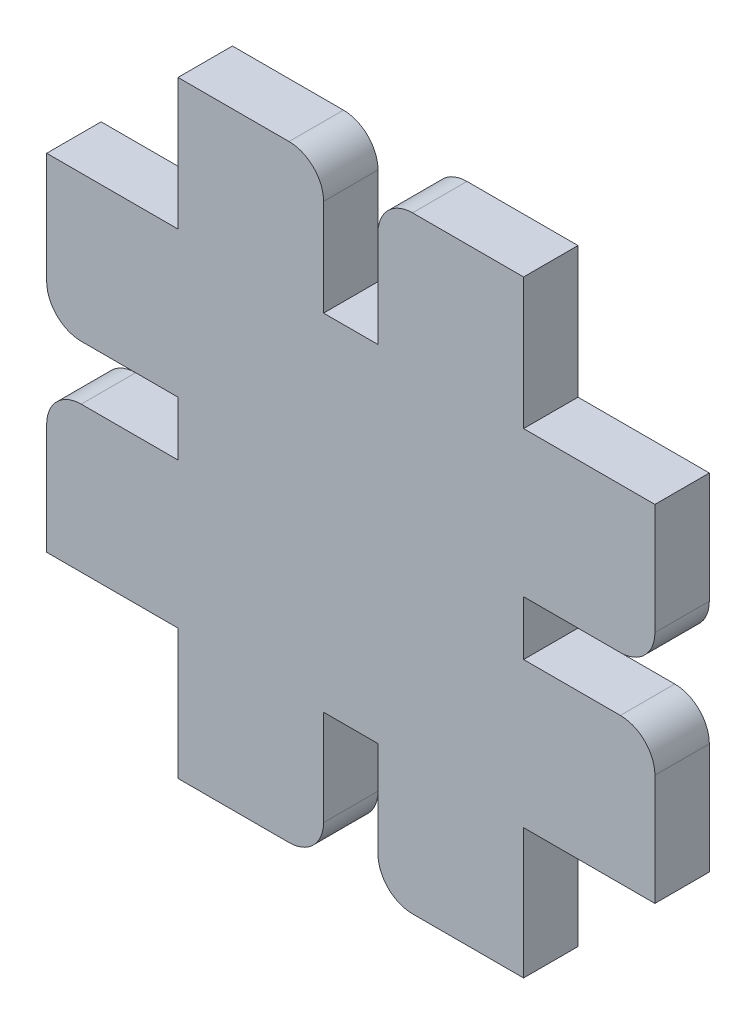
ISO-10303-21;
HEADER;
FILE_DESCRIPTION(('STEP AP214'),'2;1');
FILE_NAME('part.step','',(''),(''),'','','');
FILE_SCHEMA(('AUTOMOTIVE_DESIGN { 1 0 10303 214 1 1 1 1 }'));
ENDSEC;
DATA;
#1=APPLICATION_CONTEXT('core data for automotive mechanical design processes');
#2=APPLICATION_PROTOCOL_DEFINITION('international standard','automotive_design',2000,#1);
#3=PRODUCT_CONTEXT('',#1,'mechanical');
#4=PRODUCT('Part','Part','',(#3));
#5=PRODUCT_RELATED_PRODUCT_CATEGORY('part','',(#4));
#6=PRODUCT_DEFINITION_FORMATION('','',#4);
#7=PRODUCT_DEFINITION_CONTEXT('part definition',#1,'design');
#8=PRODUCT_DEFINITION('design','',#6,#7);
#9=PRODUCT_DEFINITION_SHAPE('','',#8);
#10=(LENGTH_UNIT() NAMED_UNIT(*) SI_UNIT(.MILLI.,.METRE.));
#11=(NAMED_UNIT(*) PLANE_ANGLE_UNIT() SI_UNIT($,.RADIAN.));
#12=(NAMED_UNIT(*) SI_UNIT($,.STERADIAN.) SOLID_ANGLE_UNIT());
#13=UNCERTAINTY_MEASURE_WITH_UNIT(LENGTH_MEASURE(1.E-05),#10,'distance_accuracy_value','');
#14=(GEOMETRIC_REPRESENTATION_CONTEXT(3) GLOBAL_UNCERTAINTY_ASSIGNED_CONTEXT((#13)) GLOBAL_UNIT_ASSIGNED_CONTEXT((#10,
#11,#12)) REPRESENTATION_CONTEXT('',''));
#15=CARTESIAN_POINT('',(0.,0.,0.));
#16=DIRECTION('',(0.,0.,1.));
#17=DIRECTION('',(1.,0.,0.));
#18=AXIS2_PLACEMENT_3D('',#15,#16,#17);
#19=CARTESIAN_POINT('',(0.,0.,3.999992));
#20=DIRECTION('',(1.,0.,0.));
#21=DIRECTION('',(0.,1.,0.));
#22=AXIS2_PLACEMENT_3D('',#19,#20,#21);
#23=PLANE('',#22);
#24=DIRECTION('',(0.,-1.,0.));
#25=VECTOR('',#24,1.);
#26=CARTESIAN_POINT('',(0.,0.,0.));
#27=LINE('',#26,#25);
#28=CARTESIAN_POINT('',(0.,2.97013488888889,0.));
#29=VERTEX_POINT('',#28);
#30=CARTESIAN_POINT('',(0.,-1.02985711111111,0.));
#31=VERTEX_POINT('',#30);
#32=EDGE_CURVE('E286',#29,#31,#27,.T.);
#33=ORIENTED_EDGE('',*,*,#32,.F.);
#34=DIRECTION('',(0.,0.,-1.));
#35=VECTOR('',#34,1.);
#36=CARTESIAN_POINT('',(0.,2.97013488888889,3.999992));
#37=LINE('',#36,#35);
#38=CARTESIAN_POINT('',(0.,2.97013488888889,3.999992));
#39=VERTEX_POINT('',#38);
#40=EDGE_CURVE('E272',#39,#29,#37,.T.);
#41=ORIENTED_EDGE('',*,*,#40,.F.);
#42=DIRECTION('',(0.,-1.,0.));
#43=VECTOR('',#42,1.);
#44=CARTESIAN_POINT('',(0.,0.,3.999992));
#45=LINE('',#44,#43);
#46=CARTESIAN_POINT('',(0.,-1.02985711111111,3.999992));
#47=VERTEX_POINT('',#46);
#48=EDGE_CURVE('E280',#39,#47,#45,.T.);
#49=ORIENTED_EDGE('',*,*,#48,.T.);
#50=DIRECTION('',(0.,0.,-1.));
#51=VECTOR('',#50,1.);
#52=CARTESIAN_POINT('',(0.,-1.02985711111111,3.999992));
#53=LINE('',#52,#51);
#54=EDGE_CURVE('E363',#47,#31,#53,.T.);
#55=ORIENTED_EDGE('',*,*,#54,.T.);
#56=EDGE_LOOP('',(#33,#41,#49,#55));
#57=FACE_BOUND('',#56,.T.);
#58=ADVANCED_FACE('F35',(#57),#23,.T.);
#59=CARTESIAN_POINT('',(0.,2.97013488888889,3.999992));
#60=DIRECTION('',(0.,-1.,0.));
#61=DIRECTION('',(1.,0.,0.));
#62=AXIS2_PLACEMENT_3D('',#59,#60,#61);
#63=PLANE('',#62);
#64=DIRECTION('',(-1.,0.,0.));
#65=VECTOR('',#64,1.);
#66=CARTESIAN_POINT('',(0.,2.97013488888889,0.));
#67=LINE('',#66,#65);
#68=CARTESIAN_POINT('',(7.11200000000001,2.97013488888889,0.));
#69=VERTEX_POINT('',#68);
#70=EDGE_CURVE('E365',#69,#29,#67,.T.);
#71=ORIENTED_EDGE('',*,*,#70,.F.);
#72=DIRECTION('',(0.,0.,-1.));
#73=VECTOR('',#72,1.);
#74=CARTESIAN_POINT('',(7.11200000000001,2.97013488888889,3.999992));
#75=LINE('',#74,#73);
#76=CARTESIAN_POINT('',(7.11200000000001,2.97013488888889,3.999992));
#77=VERTEX_POINT('',#76);
#78=EDGE_CURVE('E275',#69,#77,#75,.F.);
#79=ORIENTED_EDGE('',*,*,#78,.T.);
#80=DIRECTION('',(-1.,0.,0.));
#81=VECTOR('',#80,1.);
#82=CARTESIAN_POINT('',(0.,2.97013488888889,3.999992));
#83=LINE('',#82,#81);
#84=EDGE_CURVE('E268',#77,#39,#83,.T.);
#85=ORIENTED_EDGE('',*,*,#84,.T.);
#86=ORIENTED_EDGE('',*,*,#40,.T.);
#87=EDGE_LOOP('',(#71,#79,#85,#86));
#88=FACE_BOUND('',#87,.T.);
#89=ADVANCED_FACE('F271',(#88),#63,.T.);
#90=CARTESIAN_POINT('',(9.65200000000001,0.,3.999992));
#91=DIRECTION('',(1.,0.,0.));
#92=DIRECTION('',(0.,1.,0.));
#93=AXIS2_PLACEMENT_3D('',#90,#91,#92);
#94=PLANE('',#93);
#95=DIRECTION('',(0.,-1.,0.));
#96=VECTOR('',#95,1.);
#97=CARTESIAN_POINT('',(9.65200000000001,0.,3.999992));
#98=LINE('',#97,#96);
#99=CARTESIAN_POINT('',(9.652,13.6701388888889,3.999992));
#100=VERTEX_POINT('',#99);
#101=CARTESIAN_POINT('',(9.65200000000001,5.51013488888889,3.999992));
#102=VERTEX_POINT('',#101);
#103=EDGE_CURVE('E279',#100,#102,#98,.T.);
#104=ORIENTED_EDGE('',*,*,#103,.T.);
#105=DIRECTION('',(0.,0.,-1.));
#106=VECTOR('',#105,1.);
#107=CARTESIAN_POINT('',(9.65200000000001,5.51013488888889,3.999992));
#108=LINE('',#107,#106);
#109=CARTESIAN_POINT('',(9.65200000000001,5.51013488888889,0.));
#110=VERTEX_POINT('',#109);
#111=EDGE_CURVE('E511',#102,#110,#108,.T.);
#112=ORIENTED_EDGE('',*,*,#111,.T.);
#113=DIRECTION('',(0.,-1.,0.));
#114=VECTOR('',#113,1.);
#115=CARTESIAN_POINT('',(9.65200000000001,0.,0.));
#116=LINE('',#115,#114);
#117=CARTESIAN_POINT('',(9.652,13.6701388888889,0.));
#118=VERTEX_POINT('',#117);
#119=EDGE_CURVE('E367',#118,#110,#116,.T.);
#120=ORIENTED_EDGE('',*,*,#119,.F.);
#121=DIRECTION('',(0.,0.,-1.));
#122=VECTOR('',#121,1.);
#123=CARTESIAN_POINT('',(9.652,13.6701388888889,3.999992));
#124=LINE('',#123,#122);
#125=EDGE_CURVE('E288',#100,#118,#124,.T.);
#126=ORIENTED_EDGE('',*,*,#125,.F.);
#127=EDGE_LOOP('',(#104,#112,#120,#126));
#128=FACE_BOUND('',#127,.T.);
#129=ADVANCED_FACE('F568',(#128),#94,.T.);
#130=CARTESIAN_POINT('',(0.,13.6701388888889,3.999992));
#131=DIRECTION('',(0.,1.,0.));
#132=DIRECTION('',(-1.,0.,0.));
#133=AXIS2_PLACEMENT_3D('',#130,#131,#132);
#134=PLANE('',#133);
#135=DIRECTION('',(1.,0.,0.));
#136=VECTOR('',#135,1.);
#137=CARTESIAN_POINT('',(0.,13.6701388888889,0.));
#138=LINE('',#137,#136);
#139=CARTESIAN_POINT('',(0.,13.6701388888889,0.));
#140=VERTEX_POINT('',#139);
#141=EDGE_CURVE('E370',#140,#118,#138,.T.);
#142=ORIENTED_EDGE('',*,*,#141,.F.);
#143=DIRECTION('',(0.,0.,-1.));
#144=VECTOR('',#143,1.);
#145=CARTESIAN_POINT('',(0.,13.6701388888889,3.999992));
#146=LINE('',#145,#144);
#147=CARTESIAN_POINT('',(0.,13.6701388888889,3.999992));
#148=VERTEX_POINT('',#147);
#149=EDGE_CURVE('E473',#148,#140,#146,.T.);
#150=ORIENTED_EDGE('',*,*,#149,.F.);
#151=DIRECTION('',(1.,0.,0.));
#152=VECTOR('',#151,1.);
#153=CARTESIAN_POINT('',(0.,13.6701388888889,3.999992));
#154=LINE('',#153,#152);
#155=EDGE_CURVE('E301',#148,#100,#154,.T.);
#156=ORIENTED_EDGE('',*,*,#155,.T.);
#157=ORIENTED_EDGE('',*,*,#125,.T.);
#158=EDGE_LOOP('',(#142,#150,#156,#157));
#159=FACE_BOUND('',#158,.T.);
#160=ADVANCED_FACE('F610',(#159),#134,.T.);
#161=CARTESIAN_POINT('',(0.,0.,3.999992));
#162=DIRECTION('',(-1.,0.,0.));
#163=DIRECTION('',(0.,-1.,0.));
#164=AXIS2_PLACEMENT_3D('',#161,#162,#163);
#165=PLANE('',#164);
#166=DIRECTION('',(0.,1.,0.));
#167=VECTOR('',#166,1.);
#168=CARTESIAN_POINT('',(0.,0.,0.));
#169=LINE('',#168,#167);
#170=CARTESIAN_POINT('',(0.,23.3221388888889,0.));
#171=VERTEX_POINT('',#170);
#172=EDGE_CURVE('E373',#140,#171,#169,.T.);
#173=ORIENTED_EDGE('',*,*,#172,.T.);
#174=DIRECTION('',(0.,0.,-1.));
#175=VECTOR('',#174,1.);
#176=CARTESIAN_POINT('',(0.,23.3221388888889,3.999992));
#177=LINE('',#176,#175);
#178=CARTESIAN_POINT('',(0.,23.3221388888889,3.999992));
#179=VERTEX_POINT('',#178);
#180=EDGE_CURVE('E470',#179,#171,#177,.T.);
#181=ORIENTED_EDGE('',*,*,#180,.F.);
#182=DIRECTION('',(0.,1.,0.));
#183=VECTOR('',#182,1.);
#184=CARTESIAN_POINT('',(0.,0.,3.999992));
#185=LINE('',#184,#183);
#186=EDGE_CURVE('E304',#148,#179,#185,.T.);
#187=ORIENTED_EDGE('',*,*,#186,.F.);
#188=ORIENTED_EDGE('',*,*,#149,.T.);
#189=EDGE_LOOP('',(#173,#181,#187,#188));
#190=FACE_BOUND('',#189,.T.);
#191=ADVANCED_FACE('F616',(#190),#165,.F.);
#192=CARTESIAN_POINT('',(0.,23.3221388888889,3.999992));
#193=DIRECTION('',(0.,-1.,0.));
#194=DIRECTION('',(1.,0.,0.));
#195=AXIS2_PLACEMENT_3D('',#192,#193,#194);
#196=PLANE('',#195);
#197=DIRECTION('',(-1.,0.,0.));
#198=VECTOR('',#197,1.);
#199=CARTESIAN_POINT('',(0.,23.3221388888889,0.));
#200=LINE('',#199,#198);
#201=CARTESIAN_POINT('',(-8.160004,23.3221388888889,0.));
#202=VERTEX_POINT('',#201);
#203=EDGE_CURVE('E375',#171,#202,#200,.T.);
#204=ORIENTED_EDGE('',*,*,#203,.T.);
#205=DIRECTION('',(0.,0.,-1.));
#206=VECTOR('',#205,1.);
#207=CARTESIAN_POINT('',(-8.160004,23.3221388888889,3.999992));
#208=LINE('',#207,#206);
#209=CARTESIAN_POINT('',(-8.160004,23.3221388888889,3.999992));
#210=VERTEX_POINT('',#209);
#211=EDGE_CURVE('E507',#202,#210,#208,.F.);
#212=ORIENTED_EDGE('',*,*,#211,.T.);
#213=DIRECTION('',(-1.,0.,0.));
#214=VECTOR('',#213,1.);
#215=CARTESIAN_POINT('',(0.,23.3221388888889,3.999992));
#216=LINE('',#215,#214);
#217=EDGE_CURVE('E306',#179,#210,#216,.T.);
#218=ORIENTED_EDGE('',*,*,#217,.F.);
#219=ORIENTED_EDGE('',*,*,#180,.T.);
#220=EDGE_LOOP('',(#204,#212,#218,#219));
#221=FACE_BOUND('',#220,.T.);
#222=ADVANCED_FACE('F620',(#221),#196,.F.);
#223=CARTESIAN_POINT('',(-10.700004,0.,3.999992));
#224=DIRECTION('',(1.,0.,0.));
#225=DIRECTION('',(0.,1.,0.));
#226=AXIS2_PLACEMENT_3D('',#223,#224,#225);
#227=PLANE('',#226);
#228=DIRECTION('',(0.,-1.,0.));
#229=VECTOR('',#228,1.);
#230=CARTESIAN_POINT('',(-10.700004,0.,3.999992));
#231=LINE('',#230,#229);
#232=CARTESIAN_POINT('',(-10.700004,20.7821388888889,3.999992));
#233=VERTEX_POINT('',#232);
#234=CARTESIAN_POINT('',(-10.700004,13.6701388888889,3.999992));
#235=VERTEX_POINT('',#234);
#236=EDGE_CURVE('E309',#233,#235,#231,.T.);
#237=ORIENTED_EDGE('',*,*,#236,.F.);
#238=DIRECTION('',(0.,0.,-1.));
#239=VECTOR('',#238,1.);
#240=CARTESIAN_POINT('',(-10.700004,20.7821388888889,3.999992));
#241=LINE('',#240,#239);
#242=CARTESIAN_POINT('',(-10.700004,20.7821388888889,0.));
#243=VERTEX_POINT('',#242);
#244=EDGE_CURVE('E502',#233,#243,#241,.T.);
#245=ORIENTED_EDGE('',*,*,#244,.T.);
#246=DIRECTION('',(0.,-1.,0.));
#247=VECTOR('',#246,1.);
#248=CARTESIAN_POINT('',(-10.700004,0.,0.));
#249=LINE('',#248,#247);
#250=CARTESIAN_POINT('',(-10.700004,13.6701388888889,0.));
#251=VERTEX_POINT('',#250);
#252=EDGE_CURVE('E378',#243,#251,#249,.T.);
#253=ORIENTED_EDGE('',*,*,#252,.T.);
#254=DIRECTION('',(0.,0.,-1.));
#255=VECTOR('',#254,1.);
#256=CARTESIAN_POINT('',(-10.700004,13.6701388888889,3.999992));
#257=LINE('',#256,#255);
#258=EDGE_CURVE('E467',#235,#251,#257,.T.);
#259=ORIENTED_EDGE('',*,*,#258,.F.);
#260=EDGE_LOOP('',(#237,#245,#253,#259));
#261=FACE_BOUND('',#260,.T.);
#262=ADVANCED_FACE('F627',(#261),#227,.F.);
#263=CARTESIAN_POINT('',(0.,13.6701388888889,3.999992));
#264=DIRECTION('',(0.,1.,0.));
#265=DIRECTION('',(0.,0.,1.));
#266=AXIS2_PLACEMENT_3D('',#263,#264,#265);
#267=PLANE('',#266);
#268=DIRECTION('',(1.,0.,0.));
#269=VECTOR('',#268,1.);
#270=CARTESIAN_POINT('',(0.,13.6701388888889,0.));
#271=LINE('',#270,#269);
#272=CARTESIAN_POINT('',(-14.699996,13.6701388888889,0.));
#273=VERTEX_POINT('',#272);
#274=EDGE_CURVE('E380',#273,#251,#271,.T.);
#275=ORIENTED_EDGE('',*,*,#274,.F.);
#276=DIRECTION('',(0.,0.,-1.));
#277=VECTOR('',#276,1.);
#278=CARTESIAN_POINT('',(-14.699996,13.6701388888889,3.999992));
#279=LINE('',#278,#277);
#280=CARTESIAN_POINT('',(-14.699996,13.6701388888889,3.999992));
#281=VERTEX_POINT('',#280);
#282=EDGE_CURVE('E464',#281,#273,#279,.T.);
#283=ORIENTED_EDGE('',*,*,#282,.F.);
#284=DIRECTION('',(1.,0.,0.));
#285=VECTOR('',#284,1.);
#286=CARTESIAN_POINT('',(0.,13.6701388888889,3.999992));
#287=LINE('',#286,#285);
#288=EDGE_CURVE('E311',#281,#235,#287,.T.);
#289=ORIENTED_EDGE('',*,*,#288,.T.);
#290=ORIENTED_EDGE('',*,*,#258,.T.);
#291=EDGE_LOOP('',(#275,#283,#289,#290));
#292=FACE_BOUND('',#291,.T.);
#293=ADVANCED_FACE('F632',(#292),#267,.T.);
#294=CARTESIAN_POINT('',(-14.699996,0.,3.999992));
#295=DIRECTION('',(1.,0.,0.));
#296=DIRECTION('',(0.,1.,0.));
#297=AXIS2_PLACEMENT_3D('',#294,#295,#296);
#298=PLANE('',#297);
#299=DIRECTION('',(0.,-1.,0.));
#300=VECTOR('',#299,1.);
#301=CARTESIAN_POINT('',(-14.699996,0.,0.));
#302=LINE('',#301,#300);
#303=CARTESIAN_POINT('',(-14.699996,20.7821388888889,0.));
#304=VERTEX_POINT('',#303);
#305=EDGE_CURVE('E383',#304,#273,#302,.T.);
#306=ORIENTED_EDGE('',*,*,#305,.F.);
#307=DIRECTION('',(0.,0.,-1.));
#308=VECTOR('',#307,1.);
#309=CARTESIAN_POINT('',(-14.699996,20.7821388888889,3.999992));
#310=LINE('',#309,#308);
#311=CARTESIAN_POINT('',(-14.699996,20.7821388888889,3.999992));
#312=VERTEX_POINT('',#311);
#313=EDGE_CURVE('E498',#304,#312,#310,.F.);
#314=ORIENTED_EDGE('',*,*,#313,.T.);
#315=DIRECTION('',(0.,-1.,0.));
#316=VECTOR('',#315,1.);
#317=CARTESIAN_POINT('',(-14.699996,0.,3.999992));
#318=LINE('',#317,#316);
#319=EDGE_CURVE('E314',#312,#281,#318,.T.);
#320=ORIENTED_EDGE('',*,*,#319,.T.);
#321=ORIENTED_EDGE('',*,*,#282,.T.);
#322=EDGE_LOOP('',(#306,#314,#320,#321));
#323=FACE_BOUND('',#322,.T.);
#324=ADVANCED_FACE('F718',(#323),#298,.T.);
#325=CARTESIAN_POINT('',(0.,23.3221388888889,3.999992));
#326=DIRECTION('',(0.,1.,0.));
#327=DIRECTION('',(0.,0.,1.));
#328=AXIS2_PLACEMENT_3D('',#325,#326,#327);
#329=PLANE('',#328);
#330=DIRECTION('',(1.,0.,0.));
#331=VECTOR('',#330,1.);
#332=CARTESIAN_POINT('',(0.,23.3221388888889,3.999992));
#333=LINE('',#332,#331);
#334=CARTESIAN_POINT('',(-25.4,23.3221388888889,3.999992));
#335=VERTEX_POINT('',#334);
#336=CARTESIAN_POINT('',(-17.239996,23.3221388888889,3.999992));
#337=VERTEX_POINT('',#336);
#338=EDGE_CURVE('E316',#335,#337,#333,.T.);
#339=ORIENTED_EDGE('',*,*,#338,.T.);
#340=DIRECTION('',(0.,0.,-1.));
#341=VECTOR('',#340,1.);
#342=CARTESIAN_POINT('',(-17.239996,23.3221388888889,3.999992));
#343=LINE('',#342,#341);
#344=CARTESIAN_POINT('',(-17.239996,23.3221388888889,0.));
#345=VERTEX_POINT('',#344);
#346=EDGE_CURVE('E493',#337,#345,#343,.T.);
#347=ORIENTED_EDGE('',*,*,#346,.T.);
#348=DIRECTION('',(1.,0.,0.));
#349=VECTOR('',#348,1.);
#350=CARTESIAN_POINT('',(0.,23.3221388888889,0.));
#351=LINE('',#350,#349);
#352=CARTESIAN_POINT('',(-25.4,23.3221388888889,0.));
#353=VERTEX_POINT('',#352);
#354=EDGE_CURVE('E385',#353,#345,#351,.T.);
#355=ORIENTED_EDGE('',*,*,#354,.F.);
#356=DIRECTION('',(0.,0.,-1.));
#357=VECTOR('',#356,1.);
#358=CARTESIAN_POINT('',(-25.4,23.3221388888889,3.999992));
#359=LINE('',#358,#357);
#360=EDGE_CURVE('E462',#335,#353,#359,.T.);
#361=ORIENTED_EDGE('',*,*,#360,.F.);
#362=EDGE_LOOP('',(#339,#347,#355,#361));
#363=FACE_BOUND('',#362,.T.);
#364=ADVANCED_FACE('F641',(#363),#329,.T.);
#365=CARTESIAN_POINT('',(-25.4,0.,3.999992));
#366=DIRECTION('',(-1.,0.,0.));
#367=DIRECTION('',(0.,-1.,0.));
#368=AXIS2_PLACEMENT_3D('',#365,#366,#367);
#369=PLANE('',#368);
#370=DIRECTION('',(0.,1.,0.));
#371=VECTOR('',#370,1.);
#372=CARTESIAN_POINT('',(-25.4,0.,0.));
#373=LINE('',#372,#371);
#374=CARTESIAN_POINT('',(-25.4,13.6701388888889,0.));
#375=VERTEX_POINT('',#374);
#376=EDGE_CURVE('E388',#375,#353,#373,.T.);
#377=ORIENTED_EDGE('',*,*,#376,.F.);
#378=DIRECTION('',(0.,0.,-1.));
#379=VECTOR('',#378,1.);
#380=CARTESIAN_POINT('',(-25.4,13.6701388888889,3.999992));
#381=LINE('',#380,#379);
#382=CARTESIAN_POINT('',(-25.4,13.6701388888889,3.999992));
#383=VERTEX_POINT('',#382);
#384=EDGE_CURVE('E460',#383,#375,#381,.T.);
#385=ORIENTED_EDGE('',*,*,#384,.F.);
#386=DIRECTION('',(0.,1.,0.));
#387=VECTOR('',#386,1.);
#388=CARTESIAN_POINT('',(-25.4,0.,3.999992));
#389=LINE('',#388,#387);
#390=EDGE_CURVE('E319',#383,#335,#389,.T.);
#391=ORIENTED_EDGE('',*,*,#390,.T.);
#392=ORIENTED_EDGE('',*,*,#360,.T.);
#393=EDGE_LOOP('',(#377,#385,#391,#392));
#394=FACE_BOUND('',#393,.T.);
#395=ADVANCED_FACE('F647',(#394),#369,.T.);
#396=CARTESIAN_POINT('',(0.,13.6701388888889,3.999992));
#397=DIRECTION('',(0.,-1.,0.));
#398=DIRECTION('',(1.,0.,0.));
#399=AXIS2_PLACEMENT_3D('',#396,#397,#398);
#400=PLANE('',#399);
#401=DIRECTION('',(-1.,0.,0.));
#402=VECTOR('',#401,1.);
#403=CARTESIAN_POINT('',(0.,13.6701388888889,0.));
#404=LINE('',#403,#402);
#405=CARTESIAN_POINT('',(-35.052,13.6701388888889,0.));
#406=VERTEX_POINT('',#405);
#407=EDGE_CURVE('E391',#375,#406,#404,.T.);
#408=ORIENTED_EDGE('',*,*,#407,.T.);
#409=DIRECTION('',(0.,0.,-1.));
#410=VECTOR('',#409,1.);
#411=CARTESIAN_POINT('',(-35.052,13.6701388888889,3.999992));
#412=LINE('',#411,#410);
#413=CARTESIAN_POINT('',(-35.052,13.6701388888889,3.999992));
#414=VERTEX_POINT('',#413);
#415=EDGE_CURVE('E457',#414,#406,#412,.T.);
#416=ORIENTED_EDGE('',*,*,#415,.F.);
#417=DIRECTION('',(-1.,0.,0.));
#418=VECTOR('',#417,1.);
#419=CARTESIAN_POINT('',(0.,13.6701388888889,3.999992));
#420=LINE('',#419,#418);
#421=EDGE_CURVE('E322',#383,#414,#420,.T.);
#422=ORIENTED_EDGE('',*,*,#421,.F.);
#423=ORIENTED_EDGE('',*,*,#384,.T.);
#424=EDGE_LOOP('',(#408,#416,#422,#423));
#425=FACE_BOUND('',#424,.T.);
#426=ADVANCED_FACE('F654',(#425),#400,.F.);
#427=CARTESIAN_POINT('',(-35.052,0.,3.999992));
#428=DIRECTION('',(1.,0.,0.));
#429=DIRECTION('',(0.,0.,-1.));
#430=AXIS2_PLACEMENT_3D('',#427,#428,#429);
#431=PLANE('',#430);
#432=DIRECTION('',(0.,-1.,0.));
#433=VECTOR('',#432,1.);
#434=CARTESIAN_POINT('',(-35.052,0.,0.));
#435=LINE('',#434,#433);
#436=CARTESIAN_POINT('',(-35.052,5.51013488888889,0.));
#437=VERTEX_POINT('',#436);
#438=EDGE_CURVE('E393',#406,#437,#435,.T.);
#439=ORIENTED_EDGE('',*,*,#438,.T.);
#440=DIRECTION('',(0.,0.,-1.));
#441=VECTOR('',#440,1.);
#442=CARTESIAN_POINT('',(-35.052,5.51013488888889,3.999992));
#443=LINE('',#442,#441);
#444=CARTESIAN_POINT('',(-35.052,5.51013488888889,3.999992));
#445=VERTEX_POINT('',#444);
#446=EDGE_CURVE('E480',#437,#445,#443,.F.);
#447=ORIENTED_EDGE('',*,*,#446,.T.);
#448=DIRECTION('',(0.,-1.,0.));
#449=VECTOR('',#448,1.);
#450=CARTESIAN_POINT('',(-35.052,0.,3.999992));
#451=LINE('',#450,#449);
#452=EDGE_CURVE('E324',#414,#445,#451,.T.);
#453=ORIENTED_EDGE('',*,*,#452,.F.);
#454=ORIENTED_EDGE('',*,*,#415,.T.);
#455=EDGE_LOOP('',(#439,#447,#453,#454));
#456=FACE_BOUND('',#455,.T.);
#457=ADVANCED_FACE('F656',(#456),#431,.F.);
#458=CARTESIAN_POINT('',(0.,2.97013488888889,3.999992));
#459=DIRECTION('',(0.,1.,0.));
#460=DIRECTION('',(0.,0.,1.));
#461=AXIS2_PLACEMENT_3D('',#458,#459,#460);
#462=PLANE('',#461);
#463=DIRECTION('',(1.,0.,0.));
#464=VECTOR('',#463,1.);
#465=CARTESIAN_POINT('',(0.,2.97013488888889,3.999992));
#466=LINE('',#465,#464);
#467=CARTESIAN_POINT('',(-32.512,2.97013488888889,3.999992));
#468=VERTEX_POINT('',#467);
#469=CARTESIAN_POINT('',(-25.4,2.97013488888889,3.999992));
#470=VERTEX_POINT('',#469);
#471=EDGE_CURVE('E327',#468,#470,#466,.T.);
#472=ORIENTED_EDGE('',*,*,#471,.F.);
#473=DIRECTION('',(0.,0.,-1.));
#474=VECTOR('',#473,1.);
#475=CARTESIAN_POINT('',(-32.512,2.97013488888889,3.999992));
#476=LINE('',#475,#474);
#477=CARTESIAN_POINT('',(-32.512,2.97013488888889,0.));
#478=VERTEX_POINT('',#477);
#479=EDGE_CURVE('E287',#468,#478,#476,.T.);
#480=ORIENTED_EDGE('',*,*,#479,.T.);
#481=DIRECTION('',(1.,0.,0.));
#482=VECTOR('',#481,1.);
#483=CARTESIAN_POINT('',(0.,2.97013488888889,0.));
#484=LINE('',#483,#482);
#485=CARTESIAN_POINT('',(-25.4,2.97013488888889,0.));
#486=VERTEX_POINT('',#485);
#487=EDGE_CURVE('E396',#478,#486,#484,.T.);
#488=ORIENTED_EDGE('',*,*,#487,.T.);
#489=DIRECTION('',(0.,0.,-1.));
#490=VECTOR('',#489,1.);
#491=CARTESIAN_POINT('',(-25.4,2.97013488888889,3.999992));
#492=LINE('',#491,#490);
#493=EDGE_CURVE('E454',#470,#486,#492,.T.);
#494=ORIENTED_EDGE('',*,*,#493,.F.);
#495=EDGE_LOOP('',(#472,#480,#488,#494));
#496=FACE_BOUND('',#495,.T.);
#497=ADVANCED_FACE('F662',(#496),#462,.F.);
#498=CARTESIAN_POINT('',(-25.4,0.,3.999992));
#499=DIRECTION('',(1.,0.,0.));
#500=DIRECTION('',(0.,1.,0.));
#501=AXIS2_PLACEMENT_3D('',#498,#499,#500);
#502=PLANE('',#501);
#503=DIRECTION('',(0.,-1.,0.));
#504=VECTOR('',#503,1.);
#505=CARTESIAN_POINT('',(-25.4,0.,0.));
#506=LINE('',#505,#504);
#507=CARTESIAN_POINT('',(-25.4,-1.02985711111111,0.));
#508=VERTEX_POINT('',#507);
#509=EDGE_CURVE('E398',#486,#508,#506,.T.);
#510=ORIENTED_EDGE('',*,*,#509,.T.);
#511=DIRECTION('',(0.,0.,-1.));
#512=VECTOR('',#511,1.);
#513=CARTESIAN_POINT('',(-25.4,-1.02985711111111,3.999992));
#514=LINE('',#513,#512);
#515=CARTESIAN_POINT('',(-25.4,-1.02985711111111,3.999992));
#516=VERTEX_POINT('',#515);
#517=EDGE_CURVE('E451',#516,#508,#514,.T.);
#518=ORIENTED_EDGE('',*,*,#517,.F.);
#519=DIRECTION('',(0.,-1.,0.));
#520=VECTOR('',#519,1.);
#521=CARTESIAN_POINT('',(-25.4,0.,3.999992));
#522=LINE('',#521,#520);
#523=EDGE_CURVE('E329',#470,#516,#522,.T.);
#524=ORIENTED_EDGE('',*,*,#523,.F.);
#525=ORIENTED_EDGE('',*,*,#493,.T.);
#526=EDGE_LOOP('',(#510,#518,#524,#525));
#527=FACE_BOUND('',#526,.T.);
#528=ADVANCED_FACE('F668',(#527),#502,.F.);
#529=CARTESIAN_POINT('',(0.,-1.02985711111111,3.999992));
#530=DIRECTION('',(0.,1.,0.));
#531=DIRECTION('',(0.,0.,1.));
#532=AXIS2_PLACEMENT_3D('',#529,#530,#531);
#533=PLANE('',#532);
#534=DIRECTION('',(1.,0.,0.));
#535=VECTOR('',#534,1.);
#536=CARTESIAN_POINT('',(0.,-1.02985711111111,0.));
#537=LINE('',#536,#535);
#538=CARTESIAN_POINT('',(-32.512,-1.02985711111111,0.));
#539=VERTEX_POINT('',#538);
#540=EDGE_CURVE('E401',#539,#508,#537,.T.);
#541=ORIENTED_EDGE('',*,*,#540,.F.);
#542=DIRECTION('',(0.,0.,-1.));
#543=VECTOR('',#542,1.);
#544=CARTESIAN_POINT('',(-32.512,-1.02985711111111,3.999992));
#545=LINE('',#544,#543);
#546=CARTESIAN_POINT('',(-32.512,-1.02985711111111,3.999992));
#547=VERTEX_POINT('',#546);
#548=EDGE_CURVE('E489',#539,#547,#545,.F.);
#549=ORIENTED_EDGE('',*,*,#548,.T.);
#550=DIRECTION('',(1.,0.,0.));
#551=VECTOR('',#550,1.);
#552=CARTESIAN_POINT('',(0.,-1.02985711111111,3.999992));
#553=LINE('',#552,#551);
#554=EDGE_CURVE('E332',#547,#516,#553,.T.);
#555=ORIENTED_EDGE('',*,*,#554,.T.);
#556=ORIENTED_EDGE('',*,*,#517,.T.);
#557=EDGE_LOOP('',(#541,#549,#555,#556));
#558=FACE_BOUND('',#557,.T.);
#559=ADVANCED_FACE('F703',(#558),#533,.T.);
#560=CARTESIAN_POINT('',(-35.052,0.,3.999992));
#561=DIRECTION('',(-1.,0.,0.));
#562=DIRECTION('',(0.,0.,1.));
#563=AXIS2_PLACEMENT_3D('',#560,#561,#562);
#564=PLANE('',#563);
#565=DIRECTION('',(0.,1.,0.));
#566=VECTOR('',#565,1.);
#567=CARTESIAN_POINT('',(-35.052,0.,3.999992));
#568=LINE('',#567,#566);
#569=CARTESIAN_POINT('',(-35.052,-11.7298611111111,3.999992));
#570=VERTEX_POINT('',#569);
#571=CARTESIAN_POINT('',(-35.052,-3.56985711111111,3.999992));
#572=VERTEX_POINT('',#571);
#573=EDGE_CURVE('E334',#570,#572,#568,.T.);
#574=ORIENTED_EDGE('',*,*,#573,.T.);
#575=DIRECTION('',(0.,0.,-1.));
#576=VECTOR('',#575,1.);
#577=CARTESIAN_POINT('',(-35.052,-3.56985711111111,3.999992));
#578=LINE('',#577,#576);
#579=CARTESIAN_POINT('',(-35.052,-3.56985711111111,0.));
#580=VERTEX_POINT('',#579);
#581=EDGE_CURVE('E484',#572,#580,#578,.T.);
#582=ORIENTED_EDGE('',*,*,#581,.T.);
#583=DIRECTION('',(0.,1.,0.));
#584=VECTOR('',#583,1.);
#585=CARTESIAN_POINT('',(-35.052,0.,0.));
#586=LINE('',#585,#584);
#587=CARTESIAN_POINT('',(-35.052,-11.7298611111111,0.));
#588=VERTEX_POINT('',#587);
#589=EDGE_CURVE('E403',#588,#580,#586,.T.);
#590=ORIENTED_EDGE('',*,*,#589,.F.);
#591=DIRECTION('',(0.,0.,-1.));
#592=VECTOR('',#591,1.);
#593=CARTESIAN_POINT('',(-35.052,-11.7298611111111,3.999992));
#594=LINE('',#593,#592);
#595=EDGE_CURVE('E449',#570,#588,#594,.T.);
#596=ORIENTED_EDGE('',*,*,#595,.F.);
#597=EDGE_LOOP('',(#574,#582,#590,#596));
#598=FACE_BOUND('',#597,.T.);
#599=ADVANCED_FACE('F677',(#598),#564,.T.);
#600=CARTESIAN_POINT('',(0.,-11.7298611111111,3.999992));
#601=DIRECTION('',(0.,-1.,0.));
#602=DIRECTION('',(1.,0.,0.));
#603=AXIS2_PLACEMENT_3D('',#600,#601,#602);
#604=PLANE('',#603);
#605=DIRECTION('',(-1.,0.,0.));
#606=VECTOR('',#605,1.);
#607=CARTESIAN_POINT('',(0.,-11.7298611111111,0.));
#608=LINE('',#607,#606);
#609=CARTESIAN_POINT('',(-25.4,-11.7298611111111,0.));
#610=VERTEX_POINT('',#609);
#611=EDGE_CURVE('E406',#610,#588,#608,.T.);
#612=ORIENTED_EDGE('',*,*,#611,.F.);
#613=DIRECTION('',(0.,0.,-1.));
#614=VECTOR('',#613,1.);
#615=CARTESIAN_POINT('',(-25.4,-11.7298611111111,3.999992));
#616=LINE('',#615,#614);
#617=CARTESIAN_POINT('',(-25.4,-11.7298611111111,3.999992));
#618=VERTEX_POINT('',#617);
#619=EDGE_CURVE('E447',#618,#610,#616,.T.);
#620=ORIENTED_EDGE('',*,*,#619,.F.);
#621=DIRECTION('',(-1.,0.,0.));
#622=VECTOR('',#621,1.);
#623=CARTESIAN_POINT('',(0.,-11.7298611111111,3.999992));
#624=LINE('',#623,#622);
#625=EDGE_CURVE('E337',#618,#570,#624,.T.);
#626=ORIENTED_EDGE('',*,*,#625,.T.);
#627=ORIENTED_EDGE('',*,*,#595,.T.);
#628=EDGE_LOOP('',(#612,#620,#626,#627));
#629=FACE_BOUND('',#628,.T.);
#630=ADVANCED_FACE('F682',(#629),#604,.T.);
#631=CARTESIAN_POINT('',(-25.4,0.,3.999992));
#632=DIRECTION('',(1.,0.,0.));
#633=DIRECTION('',(0.,0.,-1.));
#634=AXIS2_PLACEMENT_3D('',#631,#632,#633);
#635=PLANE('',#634);
#636=DIRECTION('',(0.,-1.,0.));
#637=VECTOR('',#636,1.);
#638=CARTESIAN_POINT('',(-25.4,0.,0.));
#639=LINE('',#638,#637);
#640=CARTESIAN_POINT('',(-25.4,-21.3002480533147,0.));
#641=VERTEX_POINT('',#640);
#642=EDGE_CURVE('E409',#610,#641,#639,.T.);
#643=ORIENTED_EDGE('',*,*,#642,.T.);
#644=DIRECTION('',(0.,0.,-1.));
#645=VECTOR('',#644,1.);
#646=CARTESIAN_POINT('',(-25.4,-21.3002480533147,3.999992));
#647=LINE('',#646,#645);
#648=CARTESIAN_POINT('',(-25.4,-21.3002480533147,3.999992));
#649=VERTEX_POINT('',#648);
#650=EDGE_CURVE('E444',#649,#641,#647,.T.);
#651=ORIENTED_EDGE('',*,*,#650,.F.);
#652=DIRECTION('',(0.,-1.,0.));
#653=VECTOR('',#652,1.);
#654=CARTESIAN_POINT('',(-25.4,0.,3.999992));
#655=LINE('',#654,#653);
#656=EDGE_CURVE('E340',#618,#649,#655,.T.);
#657=ORIENTED_EDGE('',*,*,#656,.F.);
#658=ORIENTED_EDGE('',*,*,#619,.T.);
#659=EDGE_LOOP('',(#643,#651,#657,#658));
#660=FACE_BOUND('',#659,.T.);
#661=ADVANCED_FACE('F687',(#660),#635,.F.);
#662=CARTESIAN_POINT('',(0.,-21.3002480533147,3.999992));
#663=DIRECTION('',(0.,1.,0.));
#664=DIRECTION('',(0.,0.,1.));
#665=AXIS2_PLACEMENT_3D('',#662,#663,#664);
#666=PLANE('',#665);
#667=DIRECTION('',(1.,0.,0.));
#668=VECTOR('',#667,1.);
#669=CARTESIAN_POINT('',(0.,-21.3002480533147,0.));
#670=LINE('',#669,#668);
#671=CARTESIAN_POINT('',(-17.239996,-21.3002480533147,0.));
#672=VERTEX_POINT('',#671);
#673=EDGE_CURVE('E411',#641,#672,#670,.T.);
#674=ORIENTED_EDGE('',*,*,#673,.T.);
#675=DIRECTION('',(0.,0.,-1.));
#676=VECTOR('',#675,1.);
#677=CARTESIAN_POINT('',(-17.239996,-21.3002480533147,3.999992));
#678=LINE('',#677,#676);
#679=CARTESIAN_POINT('',(-17.239996,-21.3002480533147,3.999992));
#680=VERTEX_POINT('',#679);
#681=EDGE_CURVE('E43',#672,#680,#678,.F.);
#682=ORIENTED_EDGE('',*,*,#681,.T.);
#683=DIRECTION('',(1.,0.,0.));
#684=VECTOR('',#683,1.);
#685=CARTESIAN_POINT('',(0.,-21.3002480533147,3.999992));
#686=LINE('',#685,#684);
#687=EDGE_CURVE('E342',#649,#680,#686,.T.);
#688=ORIENTED_EDGE('',*,*,#687,.F.);
#689=ORIENTED_EDGE('',*,*,#650,.T.);
#690=EDGE_LOOP('',(#674,#682,#688,#689));
#691=FACE_BOUND('',#690,.T.);
#692=ADVANCED_FACE('F688',(#691),#666,.F.);
#693=CARTESIAN_POINT('',(-14.699996,0.,3.999992));
#694=DIRECTION('',(-1.,0.,0.));
#695=DIRECTION('',(0.,0.,1.));
#696=AXIS2_PLACEMENT_3D('',#693,#694,#695);
#697=PLANE('',#696);
#698=DIRECTION('',(0.,1.,0.));
#699=VECTOR('',#698,1.);
#700=CARTESIAN_POINT('',(-14.699996,0.,3.999992));
#701=LINE('',#700,#699);
#702=CARTESIAN_POINT('',(-14.699996,-18.7602480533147,3.999992));
#703=VERTEX_POINT('',#702);
#704=CARTESIAN_POINT('',(-14.699996,-11.7298611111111,3.999992));
#705=VERTEX_POINT('',#704);
#706=EDGE_CURVE('E344',#703,#705,#701,.T.);
#707=ORIENTED_EDGE('',*,*,#706,.F.);
#708=DIRECTION('',(0.,0.,-1.));
#709=VECTOR('',#708,1.);
#710=CARTESIAN_POINT('',(-14.699996,-18.7602480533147,3.999992));
#711=LINE('',#710,#709);
#712=CARTESIAN_POINT('',(-14.699996,-18.7602480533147,0.));
#713=VERTEX_POINT('',#712);
#714=EDGE_CURVE('E537',#703,#713,#711,.T.);
#715=ORIENTED_EDGE('',*,*,#714,.T.);
#716=DIRECTION('',(0.,1.,0.));
#717=VECTOR('',#716,1.);
#718=CARTESIAN_POINT('',(-14.699996,0.,0.));
#719=LINE('',#718,#717);
#720=CARTESIAN_POINT('',(-14.699996,-11.7298611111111,0.));
#721=VERTEX_POINT('',#720);
#722=EDGE_CURVE('E413',#713,#721,#719,.T.);
#723=ORIENTED_EDGE('',*,*,#722,.T.);
#724=DIRECTION('',(0.,0.,-1.));
#725=VECTOR('',#724,1.);
#726=CARTESIAN_POINT('',(-14.699996,-11.7298611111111,3.999992));
#727=LINE('',#726,#725);
#728=EDGE_CURVE('E441',#705,#721,#727,.T.);
#729=ORIENTED_EDGE('',*,*,#728,.F.);
#730=EDGE_LOOP('',(#707,#715,#723,#729));
#731=FACE_BOUND('',#730,.T.);
#732=ADVANCED_FACE('F543',(#731),#697,.F.);
#733=CARTESIAN_POINT('',(0.,-11.7298611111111,3.999992));
#734=DIRECTION('',(0.,1.,0.));
#735=DIRECTION('',(-1.,0.,0.));
#736=AXIS2_PLACEMENT_3D('',#733,#734,#735);
#737=PLANE('',#736);
#738=DIRECTION('',(1.,0.,0.));
#739=VECTOR('',#738,1.);
#740=CARTESIAN_POINT('',(0.,-11.7298611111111,0.));
#741=LINE('',#740,#739);
#742=CARTESIAN_POINT('',(-10.700004,-11.7298611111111,0.));
#743=VERTEX_POINT('',#742);
#744=EDGE_CURVE('E415',#721,#743,#741,.T.);
#745=ORIENTED_EDGE('',*,*,#744,.T.);
#746=DIRECTION('',(0.,0.,-1.));
#747=VECTOR('',#746,1.);
#748=CARTESIAN_POINT('',(-10.700004,-11.7298611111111,3.999992));
#749=LINE('',#748,#747);
#750=CARTESIAN_POINT('',(-10.700004,-11.7298611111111,3.999992));
#751=VERTEX_POINT('',#750);
#752=EDGE_CURVE('E438',#751,#743,#749,.T.);
#753=ORIENTED_EDGE('',*,*,#752,.F.);
#754=DIRECTION('',(1.,0.,0.));
#755=VECTOR('',#754,1.);
#756=CARTESIAN_POINT('',(0.,-11.7298611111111,3.999992));
#757=LINE('',#756,#755);
#758=EDGE_CURVE('E346',#705,#751,#757,.T.);
#759=ORIENTED_EDGE('',*,*,#758,.F.);
#760=ORIENTED_EDGE('',*,*,#728,.T.);
#761=EDGE_LOOP('',(#745,#753,#759,#760));
#762=FACE_BOUND('',#761,.T.);
#763=ADVANCED_FACE('F552',(#762),#737,.F.);
#764=CARTESIAN_POINT('',(-10.700004,0.,3.999992));
#765=DIRECTION('',(-1.,0.,0.));
#766=DIRECTION('',(0.,0.,1.));
#767=AXIS2_PLACEMENT_3D('',#764,#765,#766);
#768=PLANE('',#767);
#769=DIRECTION('',(0.,1.,0.));
#770=VECTOR('',#769,1.);
#771=CARTESIAN_POINT('',(-10.700004,0.,0.));
#772=LINE('',#771,#770);
#773=CARTESIAN_POINT('',(-10.700004,-18.7602480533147,0.));
#774=VERTEX_POINT('',#773);
#775=EDGE_CURVE('E418',#774,#743,#772,.T.);
#776=ORIENTED_EDGE('',*,*,#775,.F.);
#777=DIRECTION('',(0.,0.,-1.));
#778=VECTOR('',#777,1.);
#779=CARTESIAN_POINT('',(-10.700004,-18.7602480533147,3.999992));
#780=LINE('',#779,#778);
#781=CARTESIAN_POINT('',(-10.700004,-18.7602480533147,3.999992));
#782=VERTEX_POINT('',#781);
#783=EDGE_CURVE('E533',#774,#782,#780,.F.);
#784=ORIENTED_EDGE('',*,*,#783,.T.);
#785=DIRECTION('',(0.,1.,0.));
#786=VECTOR('',#785,1.);
#787=CARTESIAN_POINT('',(-10.700004,0.,3.999992));
#788=LINE('',#787,#786);
#789=EDGE_CURVE('E349',#782,#751,#788,.T.);
#790=ORIENTED_EDGE('',*,*,#789,.T.);
#791=ORIENTED_EDGE('',*,*,#752,.T.);
#792=EDGE_LOOP('',(#776,#784,#790,#791));
#793=FACE_BOUND('',#792,.T.);
#794=ADVANCED_FACE('F815',(#793),#768,.T.);
#795=CARTESIAN_POINT('',(0.,-21.3002480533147,3.999992));
#796=DIRECTION('',(0.,-1.,0.));
#797=DIRECTION('',(0.,0.,-1.));
#798=AXIS2_PLACEMENT_3D('',#795,#796,#797);
#799=PLANE('',#798);
#800=DIRECTION('',(-1.,0.,0.));
#801=VECTOR('',#800,1.);
#802=CARTESIAN_POINT('',(0.,-21.3002480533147,3.999992));
#803=LINE('',#802,#801);
#804=CARTESIAN_POINT('',(0.,-21.3002480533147,3.999992));
#805=VERTEX_POINT('',#804);
#806=CARTESIAN_POINT('',(-8.160004,-21.3002480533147,3.999992));
#807=VERTEX_POINT('',#806);
#808=EDGE_CURVE('E351',#805,#807,#803,.T.);
#809=ORIENTED_EDGE('',*,*,#808,.T.);
#810=DIRECTION('',(0.,0.,-1.));
#811=VECTOR('',#810,1.);
#812=CARTESIAN_POINT('',(-8.160004,-21.3002480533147,3.999992));
#813=LINE('',#812,#811);
#814=CARTESIAN_POINT('',(-8.160004,-21.3002480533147,0.));
#815=VERTEX_POINT('',#814);
#816=EDGE_CURVE('E528',#807,#815,#813,.T.);
#817=ORIENTED_EDGE('',*,*,#816,.T.);
#818=DIRECTION('',(-1.,0.,0.));
#819=VECTOR('',#818,1.);
#820=CARTESIAN_POINT('',(0.,-21.3002480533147,0.));
#821=LINE('',#820,#819);
#822=CARTESIAN_POINT('',(0.,-21.3002480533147,0.));
#823=VERTEX_POINT('',#822);
#824=EDGE_CURVE('E420',#823,#815,#821,.T.);
#825=ORIENTED_EDGE('',*,*,#824,.F.);
#826=DIRECTION('',(0.,0.,-1.));
#827=VECTOR('',#826,1.);
#828=CARTESIAN_POINT('',(0.,-21.3002480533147,3.999992));
#829=LINE('',#828,#827);
#830=EDGE_CURVE('E436',#805,#823,#829,.T.);
#831=ORIENTED_EDGE('',*,*,#830,.F.);
#832=EDGE_LOOP('',(#809,#817,#825,#831));
#833=FACE_BOUND('',#832,.T.);
#834=ADVANCED_FACE('F827',(#833),#799,.T.);
#835=CARTESIAN_POINT('',(0.,0.,3.999992));
#836=DIRECTION('',(1.,0.,0.));
#837=DIRECTION('',(0.,0.,-1.));
#838=AXIS2_PLACEMENT_3D('',#835,#836,#837);
#839=PLANE('',#838);
#840=DIRECTION('',(0.,-1.,0.));
#841=VECTOR('',#840,1.);
#842=CARTESIAN_POINT('',(0.,0.,0.));
#843=LINE('',#842,#841);
#844=CARTESIAN_POINT('',(0.,-11.7298611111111,0.));
#845=VERTEX_POINT('',#844);
#846=EDGE_CURVE('E423',#845,#823,#843,.T.);
#847=ORIENTED_EDGE('',*,*,#846,.F.);
#848=DIRECTION('',(0.,0.,-1.));
#849=VECTOR('',#848,1.);
#850=CARTESIAN_POINT('',(0.,-11.7298611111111,3.999992));
#851=LINE('',#850,#849);
#852=CARTESIAN_POINT('',(0.,-11.7298611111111,3.999992));
#853=VERTEX_POINT('',#852);
#854=EDGE_CURVE('E434',#853,#845,#851,.T.);
#855=ORIENTED_EDGE('',*,*,#854,.F.);
#856=DIRECTION('',(0.,-1.,0.));
#857=VECTOR('',#856,1.);
#858=CARTESIAN_POINT('',(0.,0.,3.999992));
#859=LINE('',#858,#857);
#860=EDGE_CURVE('E354',#853,#805,#859,.T.);
#861=ORIENTED_EDGE('',*,*,#860,.T.);
#862=ORIENTED_EDGE('',*,*,#830,.T.);
#863=EDGE_LOOP('',(#847,#855,#861,#862));
#864=FACE_BOUND('',#863,.T.);
#865=ADVANCED_FACE('F822',(#864),#839,.T.);
#866=CARTESIAN_POINT('',(0.,-11.7298611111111,3.999992));
#867=DIRECTION('',(0.,1.,0.));
#868=DIRECTION('',(0.,0.,1.));
#869=AXIS2_PLACEMENT_3D('',#866,#867,#868);
#870=PLANE('',#869);
#871=DIRECTION('',(1.,0.,0.));
#872=VECTOR('',#871,1.);
#873=CARTESIAN_POINT('',(0.,-11.7298611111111,0.));
#874=LINE('',#873,#872);
#875=CARTESIAN_POINT('',(9.652,-11.7298611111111,0.));
#876=VERTEX_POINT('',#875);
#877=EDGE_CURVE('E426',#845,#876,#874,.T.);
#878=ORIENTED_EDGE('',*,*,#877,.T.);
#879=DIRECTION('',(0.,0.,-1.));
#880=VECTOR('',#879,1.);
#881=CARTESIAN_POINT('',(9.652,-11.7298611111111,3.999992));
#882=LINE('',#881,#880);
#883=CARTESIAN_POINT('',(9.652,-11.7298611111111,3.999992));
#884=VERTEX_POINT('',#883);
#885=EDGE_CURVE('E431',#884,#876,#882,.T.);
#886=ORIENTED_EDGE('',*,*,#885,.F.);
#887=DIRECTION('',(1.,0.,0.));
#888=VECTOR('',#887,1.);
#889=CARTESIAN_POINT('',(0.,-11.7298611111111,3.999992));
#890=LINE('',#889,#888);
#891=EDGE_CURVE('E357',#853,#884,#890,.T.);
#892=ORIENTED_EDGE('',*,*,#891,.F.);
#893=ORIENTED_EDGE('',*,*,#854,.T.);
#894=EDGE_LOOP('',(#878,#886,#892,#893));
#895=FACE_BOUND('',#894,.T.);
#896=ADVANCED_FACE('F826',(#895),#870,.F.);
#897=CARTESIAN_POINT('',(9.652,0.,3.999992));
#898=DIRECTION('',(-1.,0.,0.));
#899=DIRECTION('',(0.,0.,1.));
#900=AXIS2_PLACEMENT_3D('',#897,#898,#899);
#901=PLANE('',#900);
#902=DIRECTION('',(0.,1.,0.));
#903=VECTOR('',#902,1.);
#904=CARTESIAN_POINT('',(9.652,0.,0.));
#905=LINE('',#904,#903);
#906=CARTESIAN_POINT('',(9.652,-3.56985711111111,0.));
#907=VERTEX_POINT('',#906);
#908=EDGE_CURVE('E296',#876,#907,#905,.T.);
#909=ORIENTED_EDGE('',*,*,#908,.T.);
#910=DIRECTION('',(0.,0.,-1.));
#911=VECTOR('',#910,1.);
#912=CARTESIAN_POINT('',(9.652,-3.56985711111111,3.999992));
#913=LINE('',#912,#911);
#914=CARTESIAN_POINT('',(9.652,-3.56985711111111,3.999992));
#915=VERTEX_POINT('',#914);
#916=EDGE_CURVE('E524',#907,#915,#913,.F.);
#917=ORIENTED_EDGE('',*,*,#916,.T.);
#918=DIRECTION('',(0.,1.,0.));
#919=VECTOR('',#918,1.);
#920=CARTESIAN_POINT('',(9.652,0.,3.999992));
#921=LINE('',#920,#919);
#922=EDGE_CURVE('E359',#884,#915,#921,.T.);
#923=ORIENTED_EDGE('',*,*,#922,.F.);
#924=ORIENTED_EDGE('',*,*,#885,.T.);
#925=EDGE_LOOP('',(#909,#917,#923,#924));
#926=FACE_BOUND('',#925,.T.);
#927=ADVANCED_FACE('F838',(#926),#901,.F.);
#928=CARTESIAN_POINT('',(0.,-1.02985711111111,3.999992));
#929=DIRECTION('',(0.,-1.,0.));
#930=DIRECTION('',(1.,0.,0.));
#931=AXIS2_PLACEMENT_3D('',#928,#929,#930);
#932=PLANE('',#931);
#933=DIRECTION('',(-1.,0.,0.));
#934=VECTOR('',#933,1.);
#935=CARTESIAN_POINT('',(0.,-1.02985711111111,3.999992));
#936=LINE('',#935,#934);
#937=CARTESIAN_POINT('',(7.112,-1.02985711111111,3.999992));
#938=VERTEX_POINT('',#937);
#939=EDGE_CURVE('E292',#938,#47,#936,.T.);
#940=ORIENTED_EDGE('',*,*,#939,.F.);
#941=DIRECTION('',(0.,0.,-1.));
#942=VECTOR('',#941,1.);
#943=CARTESIAN_POINT('',(7.112,-1.02985711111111,3.999992));
#944=LINE('',#943,#942);
#945=CARTESIAN_POINT('',(7.112,-1.02985711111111,0.));
#946=VERTEX_POINT('',#945);
#947=EDGE_CURVE('E519',#938,#946,#944,.T.);
#948=ORIENTED_EDGE('',*,*,#947,.T.);
#949=DIRECTION('',(-1.,0.,0.));
#950=VECTOR('',#949,1.);
#951=CARTESIAN_POINT('',(0.,-1.02985711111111,0.));
#952=LINE('',#951,#950);
#953=EDGE_CURVE('E294',#946,#31,#952,.T.);
#954=ORIENTED_EDGE('',*,*,#953,.T.);
#955=ORIENTED_EDGE('',*,*,#54,.F.);
#956=EDGE_LOOP('',(#940,#948,#954,#955));
#957=FACE_BOUND('',#956,.T.);
#958=ADVANCED_FACE('F601',(#957),#932,.F.);
#959=CARTESIAN_POINT('',(0.,0.,3.999992));
#960=DIRECTION('',(0.,0.,1.));
#961=DIRECTION('',(1.,0.,0.));
#962=AXIS2_PLACEMENT_3D('',#959,#960,#961);
#963=PLANE('',#962);
#964=ORIENTED_EDGE('',*,*,#687,.T.);
#965=CARTESIAN_POINT('',(-17.239996,-18.7602480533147,3.999992));
#966=DIRECTION('',(0.,0.,1.));
#967=DIRECTION('',(1.,0.,0.));
#968=AXIS2_PLACEMENT_3D('',#965,#966,#967);
#969=CIRCLE('',#968,2.54);
#970=EDGE_CURVE('E11',#680,#703,#969,.T.);
#971=ORIENTED_EDGE('',*,*,#970,.T.);
#972=ORIENTED_EDGE('',*,*,#706,.T.);
#973=ORIENTED_EDGE('',*,*,#758,.T.);
#974=ORIENTED_EDGE('',*,*,#789,.F.);
#975=CARTESIAN_POINT('',(-8.160004,-18.7602480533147,3.999992));
#976=DIRECTION('',(0.,0.,1.));
#977=DIRECTION('',(1.,0.,0.));
#978=AXIS2_PLACEMENT_3D('',#975,#976,#977);
#979=CIRCLE('',#978,2.54);
#980=EDGE_CURVE('E535',#782,#807,#979,.T.);
#981=ORIENTED_EDGE('',*,*,#980,.T.);
#982=ORIENTED_EDGE('',*,*,#808,.F.);
#983=ORIENTED_EDGE('',*,*,#860,.F.);
#984=ORIENTED_EDGE('',*,*,#891,.T.);
#985=ORIENTED_EDGE('',*,*,#922,.T.);
#986=CARTESIAN_POINT('',(7.112,-3.56985711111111,3.999992));
#987=DIRECTION('',(0.,0.,1.));
#988=DIRECTION('',(1.,0.,0.));
#989=AXIS2_PLACEMENT_3D('',#986,#987,#988);
#990=CIRCLE('',#989,2.54);
#991=EDGE_CURVE('E526',#915,#938,#990,.T.);
#992=ORIENTED_EDGE('',*,*,#991,.T.);
#993=ORIENTED_EDGE('',*,*,#939,.T.);
#994=ORIENTED_EDGE('',*,*,#48,.F.);
#995=ORIENTED_EDGE('',*,*,#84,.F.);
#996=CARTESIAN_POINT('',(7.11200000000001,5.51013488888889,3.999992));
#997=DIRECTION('',(0.,0.,1.));
#998=DIRECTION('',(1.,0.,0.));
#999=AXIS2_PLACEMENT_3D('',#996,#997,#998);
#1000=CIRCLE('',#999,2.54);
#1001=EDGE_CURVE('E517',#77,#102,#1000,.T.);
#1002=ORIENTED_EDGE('',*,*,#1001,.T.);
#1003=ORIENTED_EDGE('',*,*,#103,.F.);
#1004=ORIENTED_EDGE('',*,*,#155,.F.);
#1005=ORIENTED_EDGE('',*,*,#186,.T.);
#1006=ORIENTED_EDGE('',*,*,#217,.T.);
#1007=CARTESIAN_POINT('',(-8.160004,20.7821388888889,3.999992));
#1008=DIRECTION('',(0.,0.,1.));
#1009=DIRECTION('',(1.,0.,0.));
#1010=AXIS2_PLACEMENT_3D('',#1007,#1008,#1009);
#1011=CIRCLE('',#1010,2.54);
#1012=EDGE_CURVE('E509',#210,#233,#1011,.T.);
#1013=ORIENTED_EDGE('',*,*,#1012,.T.);
#1014=ORIENTED_EDGE('',*,*,#236,.T.);
#1015=ORIENTED_EDGE('',*,*,#288,.F.);
#1016=ORIENTED_EDGE('',*,*,#319,.F.);
#1017=CARTESIAN_POINT('',(-17.239996,20.7821388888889,3.999992));
#1018=DIRECTION('',(0.,0.,1.));
#1019=DIRECTION('',(1.,0.,0.));
#1020=AXIS2_PLACEMENT_3D('',#1017,#1018,#1019);
#1021=CIRCLE('',#1020,2.54);
#1022=EDGE_CURVE('E500',#312,#337,#1021,.T.);
#1023=ORIENTED_EDGE('',*,*,#1022,.T.);
#1024=ORIENTED_EDGE('',*,*,#338,.F.);
#1025=ORIENTED_EDGE('',*,*,#390,.F.);
#1026=ORIENTED_EDGE('',*,*,#421,.T.);
#1027=ORIENTED_EDGE('',*,*,#452,.T.);
#1028=CARTESIAN_POINT('',(-32.512,5.51013488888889,3.999992));
#1029=DIRECTION('',(0.,0.,1.));
#1030=DIRECTION('',(1.,0.,0.));
#1031=AXIS2_PLACEMENT_3D('',#1028,#1029,#1030);
#1032=CIRCLE('',#1031,2.54);
#1033=EDGE_CURVE('E482',#445,#468,#1032,.T.);
#1034=ORIENTED_EDGE('',*,*,#1033,.T.);
#1035=ORIENTED_EDGE('',*,*,#471,.T.);
#1036=ORIENTED_EDGE('',*,*,#523,.T.);
#1037=ORIENTED_EDGE('',*,*,#554,.F.);
#1038=CARTESIAN_POINT('',(-32.512,-3.56985711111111,3.999992));
#1039=DIRECTION('',(0.,0.,1.));
#1040=DIRECTION('',(1.,0.,0.));
#1041=AXIS2_PLACEMENT_3D('',#1038,#1039,#1040);
#1042=CIRCLE('',#1041,2.54);
#1043=EDGE_CURVE('E491',#547,#572,#1042,.T.);
#1044=ORIENTED_EDGE('',*,*,#1043,.T.);
#1045=ORIENTED_EDGE('',*,*,#573,.F.);
#1046=ORIENTED_EDGE('',*,*,#625,.F.);
#1047=ORIENTED_EDGE('',*,*,#656,.T.);
#1048=EDGE_LOOP('',(#964,#971,#972,#973,#974,#981,#982,#983,#984,#985,#992,#993,#994,#995,#1002,
#1003,#1004,#1005,#1006,#1013,#1014,#1015,#1016,#1023,#1024,#1025,#1026,#1027,#1034,#1035,#1036,
#1037,#1044,#1045,#1046,#1047));
#1049=FACE_BOUND('',#1048,.T.);
#1050=ADVANCED_FACE('F290',(#1049),#963,.T.);
#1051=CARTESIAN_POINT('',(0.,0.,0.));
#1052=DIRECTION('',(0.,0.,1.));
#1053=DIRECTION('',(1.,0.,0.));
#1054=AXIS2_PLACEMENT_3D('',#1051,#1052,#1053);
#1055=PLANE('',#1054);
#1056=ORIENTED_EDGE('',*,*,#722,.F.);
#1057=CARTESIAN_POINT('',(-17.239996,-18.7602480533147,0.));
#1058=DIRECTION('',(0.,0.,1.));
#1059=DIRECTION('',(1.,0.,0.));
#1060=AXIS2_PLACEMENT_3D('',#1057,#1058,#1059);
#1061=CIRCLE('',#1060,2.54);
#1062=EDGE_CURVE('E57',#713,#672,#1061,.F.);
#1063=ORIENTED_EDGE('',*,*,#1062,.T.);
#1064=ORIENTED_EDGE('',*,*,#673,.F.);
#1065=ORIENTED_EDGE('',*,*,#642,.F.);
#1066=ORIENTED_EDGE('',*,*,#611,.T.);
#1067=ORIENTED_EDGE('',*,*,#589,.T.);
#1068=CARTESIAN_POINT('',(-32.512,-3.56985711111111,0.));
#1069=DIRECTION('',(0.,0.,1.));
#1070=DIRECTION('',(1.,0.,0.));
#1071=AXIS2_PLACEMENT_3D('',#1068,#1069,#1070);
#1072=CIRCLE('',#1071,2.54);
#1073=EDGE_CURVE('E487',#580,#539,#1072,.F.);
#1074=ORIENTED_EDGE('',*,*,#1073,.T.);
#1075=ORIENTED_EDGE('',*,*,#540,.T.);
#1076=ORIENTED_EDGE('',*,*,#509,.F.);
#1077=ORIENTED_EDGE('',*,*,#487,.F.);
#1078=CARTESIAN_POINT('',(-32.512,5.51013488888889,0.));
#1079=DIRECTION('',(0.,0.,1.));
#1080=DIRECTION('',(1.,0.,0.));
#1081=AXIS2_PLACEMENT_3D('',#1078,#1079,#1080);
#1082=CIRCLE('',#1081,2.54);
#1083=EDGE_CURVE('E478',#478,#437,#1082,.F.);
#1084=ORIENTED_EDGE('',*,*,#1083,.T.);
#1085=ORIENTED_EDGE('',*,*,#438,.F.);
#1086=ORIENTED_EDGE('',*,*,#407,.F.);
#1087=ORIENTED_EDGE('',*,*,#376,.T.);
#1088=ORIENTED_EDGE('',*,*,#354,.T.);
#1089=CARTESIAN_POINT('',(-17.239996,20.7821388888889,0.));
#1090=DIRECTION('',(0.,0.,1.));
#1091=DIRECTION('',(1.,0.,0.));
#1092=AXIS2_PLACEMENT_3D('',#1089,#1090,#1091);
#1093=CIRCLE('',#1092,2.54);
#1094=EDGE_CURVE('E496',#345,#304,#1093,.F.);
#1095=ORIENTED_EDGE('',*,*,#1094,.T.);
#1096=ORIENTED_EDGE('',*,*,#305,.T.);
#1097=ORIENTED_EDGE('',*,*,#274,.T.);
#1098=ORIENTED_EDGE('',*,*,#252,.F.);
#1099=CARTESIAN_POINT('',(-8.160004,20.7821388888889,0.));
#1100=DIRECTION('',(0.,0.,1.));
#1101=DIRECTION('',(1.,0.,0.));
#1102=AXIS2_PLACEMENT_3D('',#1099,#1100,#1101);
#1103=CIRCLE('',#1102,2.54);
#1104=EDGE_CURVE('E505',#243,#202,#1103,.F.);
#1105=ORIENTED_EDGE('',*,*,#1104,.T.);
#1106=ORIENTED_EDGE('',*,*,#203,.F.);
#1107=ORIENTED_EDGE('',*,*,#172,.F.);
#1108=ORIENTED_EDGE('',*,*,#141,.T.);
#1109=ORIENTED_EDGE('',*,*,#119,.T.);
#1110=CARTESIAN_POINT('',(7.11200000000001,5.51013488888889,0.));
#1111=DIRECTION('',(0.,0.,1.));
#1112=DIRECTION('',(1.,0.,0.));
#1113=AXIS2_PLACEMENT_3D('',#1110,#1111,#1112);
#1114=CIRCLE('',#1113,2.54);
#1115=EDGE_CURVE('E514',#110,#69,#1114,.F.);
#1116=ORIENTED_EDGE('',*,*,#1115,.T.);
#1117=ORIENTED_EDGE('',*,*,#70,.T.);
#1118=ORIENTED_EDGE('',*,*,#32,.T.);
#1119=ORIENTED_EDGE('',*,*,#953,.F.);
#1120=CARTESIAN_POINT('',(7.112,-3.56985711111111,0.));
#1121=DIRECTION('',(0.,0.,1.));
#1122=DIRECTION('',(1.,0.,0.));
#1123=AXIS2_PLACEMENT_3D('',#1120,#1121,#1122);
#1124=CIRCLE('',#1123,2.54);
#1125=EDGE_CURVE('E522',#946,#907,#1124,.F.);
#1126=ORIENTED_EDGE('',*,*,#1125,.T.);
#1127=ORIENTED_EDGE('',*,*,#908,.F.);
#1128=ORIENTED_EDGE('',*,*,#877,.F.);
#1129=ORIENTED_EDGE('',*,*,#846,.T.);
#1130=ORIENTED_EDGE('',*,*,#824,.T.);
#1131=CARTESIAN_POINT('',(-8.160004,-18.7602480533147,0.));
#1132=DIRECTION('',(0.,0.,1.));
#1133=DIRECTION('',(1.,0.,0.));
#1134=AXIS2_PLACEMENT_3D('',#1131,#1132,#1133);
#1135=CIRCLE('',#1134,2.54);
#1136=EDGE_CURVE('E531',#815,#774,#1135,.F.);
#1137=ORIENTED_EDGE('',*,*,#1136,.T.);
#1138=ORIENTED_EDGE('',*,*,#775,.T.);
#1139=ORIENTED_EDGE('',*,*,#744,.F.);
#1140=EDGE_LOOP('',(#1056,#1063,#1064,#1065,#1066,#1067,#1074,#1075,#1076,#1077,#1084,#1085,
#1086,#1087,#1088,#1095,#1096,#1097,#1098,#1105,#1106,#1107,#1108,#1109,#1116,#1117,#1118,#1119,
#1126,#1127,#1128,#1129,#1130,#1137,#1138,#1139));
#1141=FACE_BOUND('',#1140,.T.);
#1142=ADVANCED_FACE('F548',(#1141),#1055,.F.);
#1143=CARTESIAN_POINT('',(-32.512,5.51013488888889,3.999992));
#1144=DIRECTION('',(0.,0.,-1.));
#1145=DIRECTION('',(-1.,0.,0.));
#1146=AXIS2_PLACEMENT_3D('',#1143,#1144,#1145);
#1147=CYLINDRICAL_SURFACE('',#1146,2.54);
#1148=ORIENTED_EDGE('',*,*,#1033,.F.);
#1149=ORIENTED_EDGE('',*,*,#446,.F.);
#1150=ORIENTED_EDGE('',*,*,#1083,.F.);
#1151=ORIENTED_EDGE('',*,*,#479,.F.);
#1152=EDGE_LOOP('',(#1148,#1149,#1150,#1151));
#1153=FACE_BOUND('',#1152,.T.);
#1154=ADVANCED_FACE('F572',(#1153),#1147,.T.);
#1155=CARTESIAN_POINT('',(-32.512,-3.56985711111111,3.999992));
#1156=DIRECTION('',(0.,0.,-1.));
#1157=DIRECTION('',(-1.,0.,0.));
#1158=AXIS2_PLACEMENT_3D('',#1155,#1156,#1157);
#1159=CYLINDRICAL_SURFACE('',#1158,2.54);
#1160=ORIENTED_EDGE('',*,*,#1043,.F.);
#1161=ORIENTED_EDGE('',*,*,#548,.F.);
#1162=ORIENTED_EDGE('',*,*,#1073,.F.);
#1163=ORIENTED_EDGE('',*,*,#581,.F.);
#1164=EDGE_LOOP('',(#1160,#1161,#1162,#1163));
#1165=FACE_BOUND('',#1164,.T.);
#1166=ADVANCED_FACE('F575',(#1165),#1159,.T.);
#1167=CARTESIAN_POINT('',(-17.239996,20.7821388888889,3.999992));
#1168=DIRECTION('',(0.,0.,-1.));
#1169=DIRECTION('',(-1.,0.,0.));
#1170=AXIS2_PLACEMENT_3D('',#1167,#1168,#1169);
#1171=CYLINDRICAL_SURFACE('',#1170,2.54);
#1172=ORIENTED_EDGE('',*,*,#1022,.F.);
#1173=ORIENTED_EDGE('',*,*,#313,.F.);
#1174=ORIENTED_EDGE('',*,*,#1094,.F.);
#1175=ORIENTED_EDGE('',*,*,#346,.F.);
#1176=EDGE_LOOP('',(#1172,#1173,#1174,#1175));
#1177=FACE_BOUND('',#1176,.T.);
#1178=ADVANCED_FACE('F579',(#1177),#1171,.T.);
#1179=CARTESIAN_POINT('',(-8.160004,20.7821388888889,3.999992));
#1180=DIRECTION('',(0.,0.,-1.));
#1181=DIRECTION('',(-1.,0.,0.));
#1182=AXIS2_PLACEMENT_3D('',#1179,#1180,#1181);
#1183=CYLINDRICAL_SURFACE('',#1182,2.54);
#1184=ORIENTED_EDGE('',*,*,#1012,.F.);
#1185=ORIENTED_EDGE('',*,*,#211,.F.);
#1186=ORIENTED_EDGE('',*,*,#1104,.F.);
#1187=ORIENTED_EDGE('',*,*,#244,.F.);
#1188=EDGE_LOOP('',(#1184,#1185,#1186,#1187));
#1189=FACE_BOUND('',#1188,.T.);
#1190=ADVANCED_FACE('F583',(#1189),#1183,.T.);
#1191=CARTESIAN_POINT('',(7.11200000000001,5.51013488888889,3.999992));
#1192=DIRECTION('',(0.,0.,-1.));
#1193=DIRECTION('',(-1.,0.,0.));
#1194=AXIS2_PLACEMENT_3D('',#1191,#1192,#1193);
#1195=CYLINDRICAL_SURFACE('',#1194,2.54);
#1196=ORIENTED_EDGE('',*,*,#1001,.F.);
#1197=ORIENTED_EDGE('',*,*,#78,.F.);
#1198=ORIENTED_EDGE('',*,*,#1115,.F.);
#1199=ORIENTED_EDGE('',*,*,#111,.F.);
#1200=EDGE_LOOP('',(#1196,#1197,#1198,#1199));
#1201=FACE_BOUND('',#1200,.T.);
#1202=ADVANCED_FACE('F587',(#1201),#1195,.T.);
#1203=CARTESIAN_POINT('',(7.112,-3.56985711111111,3.999992));
#1204=DIRECTION('',(0.,0.,-1.));
#1205=DIRECTION('',(-1.,0.,0.));
#1206=AXIS2_PLACEMENT_3D('',#1203,#1204,#1205);
#1207=CYLINDRICAL_SURFACE('',#1206,2.54);
#1208=ORIENTED_EDGE('',*,*,#991,.F.);
#1209=ORIENTED_EDGE('',*,*,#916,.F.);
#1210=ORIENTED_EDGE('',*,*,#1125,.F.);
#1211=ORIENTED_EDGE('',*,*,#947,.F.);
#1212=EDGE_LOOP('',(#1208,#1209,#1210,#1211));
#1213=FACE_BOUND('',#1212,.T.);
#1214=ADVANCED_FACE('F561',(#1213),#1207,.T.);
#1215=CARTESIAN_POINT('',(-8.160004,-18.7602480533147,3.999992));
#1216=DIRECTION('',(0.,0.,-1.));
#1217=DIRECTION('',(-1.,0.,0.));
#1218=AXIS2_PLACEMENT_3D('',#1215,#1216,#1217);
#1219=CYLINDRICAL_SURFACE('',#1218,2.54);
#1220=ORIENTED_EDGE('',*,*,#980,.F.);
#1221=ORIENTED_EDGE('',*,*,#783,.F.);
#1222=ORIENTED_EDGE('',*,*,#1136,.F.);
#1223=ORIENTED_EDGE('',*,*,#816,.F.);
#1224=EDGE_LOOP('',(#1220,#1221,#1222,#1223));
#1225=FACE_BOUND('',#1224,.T.);
#1226=ADVANCED_FACE('F557',(#1225),#1219,.T.);
#1227=CARTESIAN_POINT('',(-17.239996,-18.7602480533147,3.999992));
#1228=DIRECTION('',(0.,0.,-1.));
#1229=DIRECTION('',(-1.,0.,0.));
#1230=AXIS2_PLACEMENT_3D('',#1227,#1228,#1229);
#1231=CYLINDRICAL_SURFACE('',#1230,2.54);
#1232=ORIENTED_EDGE('',*,*,#970,.F.);
#1233=ORIENTED_EDGE('',*,*,#681,.F.);
#1234=ORIENTED_EDGE('',*,*,#1062,.F.);
#1235=ORIENTED_EDGE('',*,*,#714,.F.);
#1236=EDGE_LOOP('',(#1232,#1233,#1234,#1235));
#1237=FACE_BOUND('',#1236,.T.);
#1238=ADVANCED_FACE('F37',(#1237),#1231,.T.);
#1239=CLOSED_SHELL('',(#58,#89,#129,#160,#191,#222,#262,#293,#324,#364,#395,#426,#457,#497,#528,
#559,#599,#630,#661,#692,#732,#763,#794,#834,#865,#896,#927,#958,#1050,#1142,#1154,#1166,#1178,
#1190,#1202,#1214,#1226,#1238));
#1240=MANIFOLD_SOLID_BREP('B2',#1239);
#1241=ADVANCED_BREP_SHAPE_REPRESENTATION('',(#18,#1240),#14);
#1242=SHAPE_DEFINITION_REPRESENTATION(#9,#1241);
ENDSEC;
END-ISO-10303-21;
